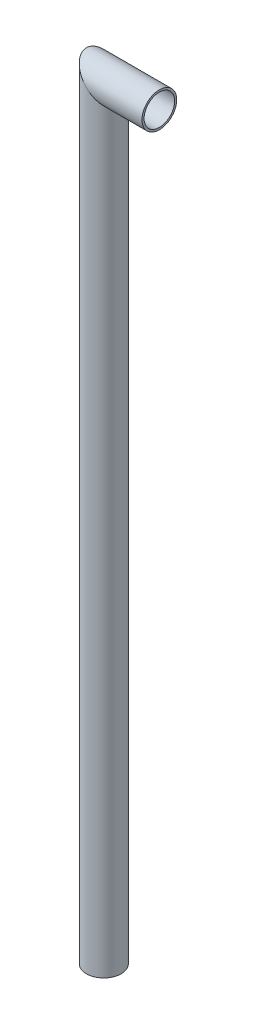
ISO-10303-21;
HEADER;
FILE_DESCRIPTION(('STEP AP214'),'2;1');
FILE_NAME('part.step','',(''),(''),'','','');
FILE_SCHEMA(('AUTOMOTIVE_DESIGN { 1 0 10303 214 1 1 1 1 }'));
ENDSEC;
DATA;
#1=APPLICATION_CONTEXT('core data for automotive mechanical design processes');
#2=APPLICATION_PROTOCOL_DEFINITION('international standard','automotive_design',2000,#1);
#3=PRODUCT_CONTEXT('',#1,'mechanical');
#4=PRODUCT('Part','Part','',(#3));
#5=PRODUCT_RELATED_PRODUCT_CATEGORY('part','',(#4));
#6=PRODUCT_DEFINITION_FORMATION('','',#4);
#7=PRODUCT_DEFINITION_CONTEXT('part definition',#1,'design');
#8=PRODUCT_DEFINITION('design','',#6,#7);
#9=PRODUCT_DEFINITION_SHAPE('','',#8);
#10=(LENGTH_UNIT() NAMED_UNIT(*) SI_UNIT(.MILLI.,.METRE.));
#11=(NAMED_UNIT(*) PLANE_ANGLE_UNIT() SI_UNIT($,.RADIAN.));
#12=(NAMED_UNIT(*) SI_UNIT($,.STERADIAN.) SOLID_ANGLE_UNIT());
#13=UNCERTAINTY_MEASURE_WITH_UNIT(LENGTH_MEASURE(1.E-05),#10,'distance_accuracy_value','');
#14=(GEOMETRIC_REPRESENTATION_CONTEXT(3) GLOBAL_UNCERTAINTY_ASSIGNED_CONTEXT((#13)) GLOBAL_UNIT_ASSIGNED_CONTEXT((#10,
#11,#12)) REPRESENTATION_CONTEXT('',''));
#15=CARTESIAN_POINT('',(0.,0.,0.));
#16=DIRECTION('',(0.,0.,1.));
#17=DIRECTION('',(1.,0.,0.));
#18=AXIS2_PLACEMENT_3D('',#15,#16,#17);
#19=CARTESIAN_POINT('',(-13.85,276.22,0.));
#20=DIRECTION('',(1.,0.,0.));
#21=DIRECTION('',(0.,0.,-1.));
#22=AXIS2_PLACEMENT_3D('',#19,#20,#21);
#23=CYLINDRICAL_SURFACE('',#22,6.25);
#24=CARTESIAN_POINT('',(0.,276.22,0.));
#25=DIRECTION('',(0.707106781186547,0.707106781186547,0.));
#26=DIRECTION('',(-0.707106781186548,0.707106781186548,0.));
#27=AXIS2_PLACEMENT_3D('',#24,#25,#26);
#28=ELLIPSE('',#27,8.83883476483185,6.25);
#29=CARTESIAN_POINT('',(-6.25,282.47,0.));
#30=VERTEX_POINT('',#29);
#31=EDGE_CURVE('E42',#30,#30,#28,.F.);
#32=ORIENTED_EDGE('',*,*,#31,.F.);
#33=EDGE_LOOP('',(#32));
#34=FACE_BOUND('',#33,.T.);
#35=CARTESIAN_POINT('',(20.,276.22,0.));
#36=DIRECTION('',(1.,0.,0.));
#37=DIRECTION('',(0.,0.,1.));
#38=AXIS2_PLACEMENT_3D('',#35,#36,#37);
#39=CIRCLE('',#38,6.25);
#40=CARTESIAN_POINT('',(20.,276.22,6.25));
#41=VERTEX_POINT('',#40);
#42=EDGE_CURVE('E54',#41,#41,#39,.T.);
#43=ORIENTED_EDGE('',*,*,#42,.F.);
#44=EDGE_LOOP('',(#43));
#45=FACE_BOUND('',#44,.T.);
#46=ADVANCED_FACE('F39',(#34,#45),#23,.T.);
#47=CARTESIAN_POINT('',(0.,0.,0.));
#48=DIRECTION('',(0.,1.,0.));
#49=DIRECTION('',(-1.,0.,0.));
#50=AXIS2_PLACEMENT_3D('',#47,#48,#49);
#51=CYLINDRICAL_SURFACE('',#50,6.25);
#52=CARTESIAN_POINT('',(0.,0.,0.));
#53=DIRECTION('',(0.,1.,0.));
#54=DIRECTION('',(0.,0.,1.));
#55=AXIS2_PLACEMENT_3D('',#52,#53,#54);
#56=CIRCLE('',#55,6.25);
#57=CARTESIAN_POINT('',(0.,0.,6.25));
#58=VERTEX_POINT('',#57);
#59=EDGE_CURVE('E60',#58,#58,#56,.T.);
#60=ORIENTED_EDGE('',*,*,#59,.T.);
#61=EDGE_LOOP('',(#60));
#62=FACE_BOUND('',#61,.T.);
#63=ORIENTED_EDGE('',*,*,#31,.T.);
#64=EDGE_LOOP('',(#63));
#65=FACE_BOUND('',#64,.T.);
#66=ADVANCED_FACE('F90',(#62,#65),#51,.T.);
#67=CARTESIAN_POINT('',(20.,276.22,0.));
#68=DIRECTION('',(1.,0.,0.));
#69=DIRECTION('',(0.,0.,1.));
#70=AXIS2_PLACEMENT_3D('',#67,#68,#69);
#71=PLANE('',#70);
#72=CARTESIAN_POINT('',(20.,276.22,0.));
#73=DIRECTION('',(1.,0.,0.));
#74=DIRECTION('',(0.,0.,1.));
#75=AXIS2_PLACEMENT_3D('',#72,#73,#74);
#76=CIRCLE('',#75,5.5);
#77=CARTESIAN_POINT('',(20.,276.22,5.5));
#78=VERTEX_POINT('',#77);
#79=EDGE_CURVE('E80',#78,#78,#76,.F.);
#80=ORIENTED_EDGE('',*,*,#79,.T.);
#81=EDGE_LOOP('',(#80));
#82=FACE_BOUND('',#81,.T.);
#83=ORIENTED_EDGE('',*,*,#42,.T.);
#84=EDGE_LOOP('',(#83));
#85=FACE_BOUND('',#84,.T.);
#86=ADVANCED_FACE('F92',(#82,#85),#71,.T.);
#87=CARTESIAN_POINT('',(0.,0.,0.));
#88=DIRECTION('',(0.,1.,0.));
#89=DIRECTION('',(0.,0.,1.));
#90=AXIS2_PLACEMENT_3D('',#87,#88,#89);
#91=PLANE('',#90);
#92=CARTESIAN_POINT('',(0.,0.,0.));
#93=DIRECTION('',(0.,1.,0.));
#94=DIRECTION('',(0.,0.,1.));
#95=AXIS2_PLACEMENT_3D('',#92,#93,#94);
#96=CIRCLE('',#95,5.5);
#97=CARTESIAN_POINT('',(0.,0.,5.5));
#98=VERTEX_POINT('',#97);
#99=EDGE_CURVE('E48',#98,#98,#96,.F.);
#100=ORIENTED_EDGE('',*,*,#99,.F.);
#101=EDGE_LOOP('',(#100));
#102=FACE_BOUND('',#101,.T.);
#103=ORIENTED_EDGE('',*,*,#59,.F.);
#104=EDGE_LOOP('',(#103));
#105=FACE_BOUND('',#104,.T.);
#106=ADVANCED_FACE('F76',(#102,#105),#91,.F.);
#107=CARTESIAN_POINT('',(-12.2,276.22,0.));
#108=DIRECTION('',(1.,0.,0.));
#109=DIRECTION('',(0.,0.,-1.));
#110=AXIS2_PLACEMENT_3D('',#107,#108,#109);
#111=CYLINDRICAL_SURFACE('',#110,5.5);
#112=CARTESIAN_POINT('',(0.,276.22,0.));
#113=DIRECTION('',(0.707106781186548,0.707106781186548,0.));
#114=DIRECTION('',(-0.707106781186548,0.707106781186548,0.));
#115=AXIS2_PLACEMENT_3D('',#112,#113,#114);
#116=ELLIPSE('',#115,7.77817459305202,5.5);
#117=CARTESIAN_POINT('',(-5.5,281.72,0.));
#118=VERTEX_POINT('',#117);
#119=EDGE_CURVE('E11',#118,#118,#116,.T.);
#120=ORIENTED_EDGE('',*,*,#119,.F.);
#121=EDGE_LOOP('',(#120));
#122=FACE_BOUND('',#121,.T.);
#123=ORIENTED_EDGE('',*,*,#79,.F.);
#124=EDGE_LOOP('',(#123));
#125=FACE_BOUND('',#124,.T.);
#126=ADVANCED_FACE('F101',(#122,#125),#111,.F.);
#127=CARTESIAN_POINT('',(0.,0.,0.));
#128=DIRECTION('',(0.,1.,0.));
#129=DIRECTION('',(-1.,0.,0.));
#130=AXIS2_PLACEMENT_3D('',#127,#128,#129);
#131=CYLINDRICAL_SURFACE('',#130,5.5);
#132=ORIENTED_EDGE('',*,*,#99,.T.);
#133=EDGE_LOOP('',(#132));
#134=FACE_BOUND('',#133,.T.);
#135=ORIENTED_EDGE('',*,*,#119,.T.);
#136=EDGE_LOOP('',(#135));
#137=FACE_BOUND('',#136,.T.);
#138=ADVANCED_FACE('F99',(#134,#137),#131,.F.);
#139=CLOSED_SHELL('',(#46,#66,#86,#106,#126,#138));
#140=MANIFOLD_SOLID_BREP('B2',#139);
#141=ADVANCED_BREP_SHAPE_REPRESENTATION('',(#18,#140),#14);
#142=SHAPE_DEFINITION_REPRESENTATION(#9,#141);
ENDSEC;
END-ISO-10303-21;
